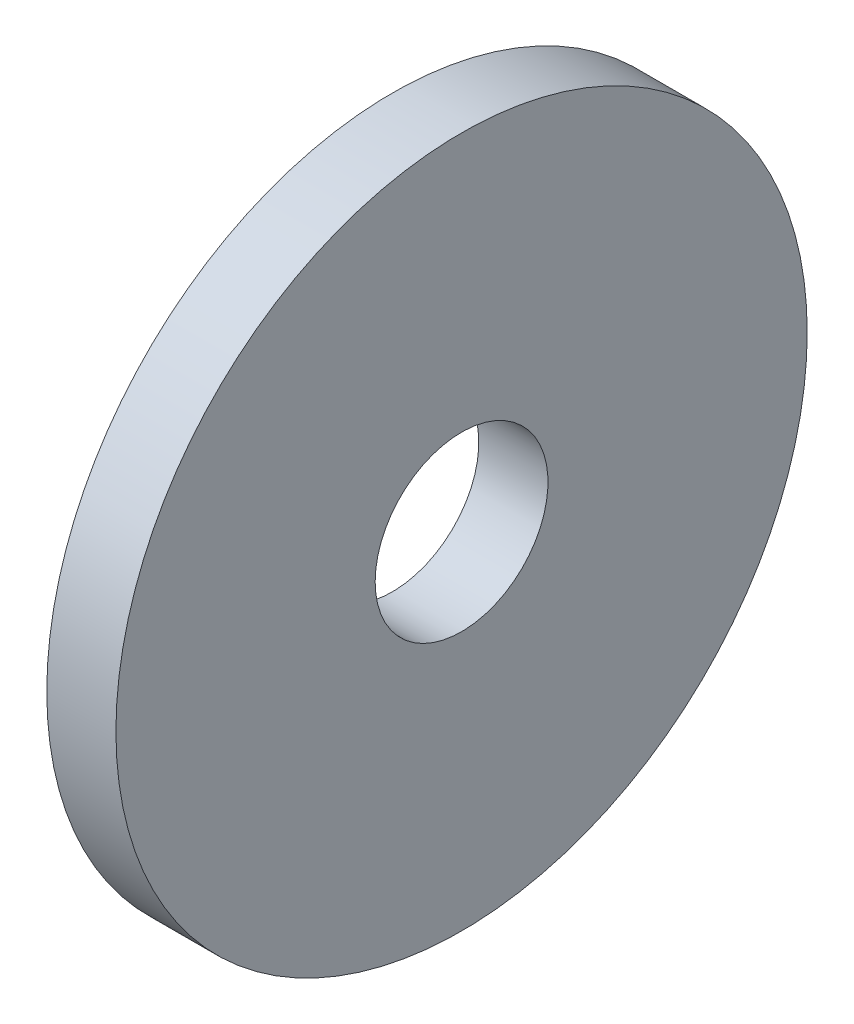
ISO-10303-21;
HEADER;
FILE_DESCRIPTION(('STEP AP214'),'2;1');
FILE_NAME('part.step','',(''),(''),'','','');
FILE_SCHEMA(('AUTOMOTIVE_DESIGN { 1 0 10303 214 1 1 1 1 }'));
ENDSEC;
DATA;
#1=APPLICATION_CONTEXT('core data for automotive mechanical design processes');
#2=APPLICATION_PROTOCOL_DEFINITION('international standard','automotive_design',2000,#1);
#3=PRODUCT_CONTEXT('',#1,'mechanical');
#4=PRODUCT('Part','Part','',(#3));
#5=PRODUCT_RELATED_PRODUCT_CATEGORY('part','',(#4));
#6=PRODUCT_DEFINITION_FORMATION('','',#4);
#7=PRODUCT_DEFINITION_CONTEXT('part definition',#1,'design');
#8=PRODUCT_DEFINITION('design','',#6,#7);
#9=PRODUCT_DEFINITION_SHAPE('','',#8);
#10=(LENGTH_UNIT() NAMED_UNIT(*) SI_UNIT(.MILLI.,.METRE.));
#11=(NAMED_UNIT(*) PLANE_ANGLE_UNIT() SI_UNIT($,.RADIAN.));
#12=(NAMED_UNIT(*) SI_UNIT($,.STERADIAN.) SOLID_ANGLE_UNIT());
#13=UNCERTAINTY_MEASURE_WITH_UNIT(LENGTH_MEASURE(1.E-05),#10,'distance_accuracy_value','');
#14=(GEOMETRIC_REPRESENTATION_CONTEXT(3) GLOBAL_UNCERTAINTY_ASSIGNED_CONTEXT((#13)) GLOBAL_UNIT_ASSIGNED_CONTEXT((#10,
#11,#12)) REPRESENTATION_CONTEXT('',''));
#15=CARTESIAN_POINT('',(0.,0.,0.));
#16=DIRECTION('',(0.,0.,1.));
#17=DIRECTION('',(1.,0.,0.));
#18=AXIS2_PLACEMENT_3D('',#15,#16,#17);
#19=CARTESIAN_POINT('',(1.35636,0.,0.));
#20=DIRECTION('',(1.,0.,0.));
#21=DIRECTION('',(0.,0.,-1.));
#22=AXIS2_PLACEMENT_3D('',#19,#20,#21);
#23=PLANE('',#22);
#24=CARTESIAN_POINT('',(1.35636,0.,0.));
#25=DIRECTION('',(1.,0.,0.));
#26=DIRECTION('',(0.,0.,-1.));
#27=AXIS2_PLACEMENT_3D('',#24,#25,#26);
#28=CIRCLE('',#27,6.7818);
#29=CARTESIAN_POINT('',(1.35636,0.,6.7818));
#30=VERTEX_POINT('',#29);
#31=EDGE_CURVE('E10',#30,#30,#28,.T.);
#32=ORIENTED_EDGE('',*,*,#31,.T.);
#33=EDGE_LOOP('',(#32));
#34=FACE_BOUND('',#33,.T.);
#35=CARTESIAN_POINT('',(1.35636,0.,0.));
#36=DIRECTION('',(1.,0.,0.));
#37=DIRECTION('',(0.,0.,-1.));
#38=AXIS2_PLACEMENT_3D('',#35,#36,#37);
#39=CIRCLE('',#38,1.69545);
#40=CARTESIAN_POINT('',(1.35636,0.,1.69545));
#41=VERTEX_POINT('',#40);
#42=EDGE_CURVE('E42',#41,#41,#39,.T.);
#43=ORIENTED_EDGE('',*,*,#42,.F.);
#44=EDGE_LOOP('',(#43));
#45=FACE_BOUND('',#44,.T.);
#46=ADVANCED_FACE('F31',(#34,#45),#23,.T.);
#47=CARTESIAN_POINT('',(0.,0.,0.));
#48=DIRECTION('',(1.,0.,0.));
#49=DIRECTION('',(0.,0.,-1.));
#50=AXIS2_PLACEMENT_3D('',#47,#48,#49);
#51=PLANE('',#50);
#52=CARTESIAN_POINT('',(0.,0.,0.));
#53=DIRECTION('',(1.,0.,0.));
#54=DIRECTION('',(0.,0.,-1.));
#55=AXIS2_PLACEMENT_3D('',#52,#53,#54);
#56=CIRCLE('',#55,6.7818);
#57=CARTESIAN_POINT('',(0.,0.,6.7818));
#58=VERTEX_POINT('',#57);
#59=EDGE_CURVE('E35',#58,#58,#56,.T.);
#60=ORIENTED_EDGE('',*,*,#59,.F.);
#61=EDGE_LOOP('',(#60));
#62=FACE_BOUND('',#61,.T.);
#63=CARTESIAN_POINT('',(0.,0.,0.));
#64=DIRECTION('',(1.,0.,0.));
#65=DIRECTION('',(0.,0.,-1.));
#66=AXIS2_PLACEMENT_3D('',#63,#64,#65);
#67=CIRCLE('',#66,1.69545);
#68=CARTESIAN_POINT('',(0.,0.,1.69545));
#69=VERTEX_POINT('',#68);
#70=EDGE_CURVE('E44',#69,#69,#67,.T.);
#71=ORIENTED_EDGE('',*,*,#70,.T.);
#72=EDGE_LOOP('',(#71));
#73=FACE_BOUND('',#72,.T.);
#74=ADVANCED_FACE('F54',(#62,#73),#51,.F.);
#75=CARTESIAN_POINT('',(1.35636,0.,0.));
#76=DIRECTION('',(-1.,0.,0.));
#77=DIRECTION('',(0.,0.,1.));
#78=AXIS2_PLACEMENT_3D('',#75,#76,#77);
#79=CYLINDRICAL_SURFACE('',#78,6.7818);
#80=CARTESIAN_POINT('',(1.35636,0.,6.7818));
#81=CARTESIAN_POINT('',(1.34223125,0.,6.7818));
#82=CARTESIAN_POINT('',(1.3281025,0.,6.7818));
#83=CARTESIAN_POINT('',(1.299845,0.,6.7818));
#84=CARTESIAN_POINT('',(1.28571625,0.,6.7818));
#85=CARTESIAN_POINT('',(1.25745875,0.,6.7818));
#86=CARTESIAN_POINT('',(1.24333,0.,6.7818));
#87=CARTESIAN_POINT('',(1.2150725,0.,6.7818));
#88=CARTESIAN_POINT('',(1.20094375,0.,6.7818));
#89=CARTESIAN_POINT('',(1.17268625,0.,6.7818));
#90=CARTESIAN_POINT('',(1.1585575,0.,6.7818));
#91=CARTESIAN_POINT('',(1.1303,0.,6.7818));
#92=CARTESIAN_POINT('',(1.11617125,0.,6.7818));
#93=CARTESIAN_POINT('',(1.08791375,0.,6.7818));
#94=CARTESIAN_POINT('',(1.073785,0.,6.7818));
#95=CARTESIAN_POINT('',(1.0455275,0.,6.7818));
#96=CARTESIAN_POINT('',(1.03139875,0.,6.7818));
#97=CARTESIAN_POINT('',(1.00314125,0.,6.7818));
#98=CARTESIAN_POINT('',(0.9890125,0.,6.7818));
#99=CARTESIAN_POINT('',(0.960755,0.,6.7818));
#100=CARTESIAN_POINT('',(0.94662625,0.,6.7818));
#101=CARTESIAN_POINT('',(0.91836875,0.,6.7818));
#102=CARTESIAN_POINT('',(0.90424,0.,6.7818));
#103=CARTESIAN_POINT('',(0.8759825,0.,6.7818));
#104=CARTESIAN_POINT('',(0.86185375,0.,6.7818));
#105=CARTESIAN_POINT('',(0.83359625,0.,6.7818));
#106=CARTESIAN_POINT('',(0.8194675,0.,6.7818));
#107=CARTESIAN_POINT('',(0.79121,0.,6.7818));
#108=CARTESIAN_POINT('',(0.77708125,0.,6.7818));
#109=CARTESIAN_POINT('',(0.74882375,0.,6.7818));
#110=CARTESIAN_POINT('',(0.734695,0.,6.7818));
#111=CARTESIAN_POINT('',(0.7064375,0.,6.7818));
#112=CARTESIAN_POINT('',(0.69230875,0.,6.7818));
#113=CARTESIAN_POINT('',(0.66405125,0.,6.7818));
#114=CARTESIAN_POINT('',(0.6499225,0.,6.7818));
#115=CARTESIAN_POINT('',(0.621665,0.,6.7818));
#116=CARTESIAN_POINT('',(0.60753625,0.,6.7818));
#117=CARTESIAN_POINT('',(0.57927875,0.,6.7818));
#118=CARTESIAN_POINT('',(0.56515,0.,6.7818));
#119=CARTESIAN_POINT('',(0.5368925,0.,6.7818));
#120=CARTESIAN_POINT('',(0.52276375,0.,6.7818));
#121=CARTESIAN_POINT('',(0.49450625,0.,6.7818));
#122=CARTESIAN_POINT('',(0.4803775,0.,6.7818));
#123=CARTESIAN_POINT('',(0.45212,0.,6.7818));
#124=CARTESIAN_POINT('',(0.43799125,0.,6.7818));
#125=CARTESIAN_POINT('',(0.40973375,0.,6.7818));
#126=CARTESIAN_POINT('',(0.395605,0.,6.7818));
#127=CARTESIAN_POINT('',(0.3673475,0.,6.7818));
#128=CARTESIAN_POINT('',(0.35321875,0.,6.7818));
#129=CARTESIAN_POINT('',(0.32496125,0.,6.7818));
#130=CARTESIAN_POINT('',(0.3108325,0.,6.7818));
#131=CARTESIAN_POINT('',(0.282575,0.,6.7818));
#132=CARTESIAN_POINT('',(0.26844625,0.,6.7818));
#133=CARTESIAN_POINT('',(0.24018875,0.,6.7818));
#134=CARTESIAN_POINT('',(0.22606,0.,6.7818));
#135=CARTESIAN_POINT('',(0.1978025,0.,6.7818));
#136=CARTESIAN_POINT('',(0.18367375,0.,6.7818));
#137=CARTESIAN_POINT('',(0.15541625,0.,6.7818));
#138=CARTESIAN_POINT('',(0.1412875,0.,6.7818));
#139=CARTESIAN_POINT('',(0.11303,0.,6.7818));
#140=CARTESIAN_POINT('',(0.0989012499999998,0.,6.7818));
#141=CARTESIAN_POINT('',(0.0706437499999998,0.,6.7818));
#142=CARTESIAN_POINT('',(0.0565149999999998,0.,6.7818));
#143=CARTESIAN_POINT('',(0.0282574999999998,0.,6.7818));
#144=CARTESIAN_POINT('',(0.0141287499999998,0.,6.7818));
#145=CARTESIAN_POINT('',(0.,0.,6.7818));
#146=B_SPLINE_CURVE_WITH_KNOTS('',3,(#80,#81,#82,#83,#84,#85,#86,#87,#88,#89,#90,#91,#92,#93,
#94,#95,#96,#97,#98,#99,#100,#101,#102,#103,#104,#105,#106,#107,#108,#109,#110,#111,#112,#113,
#114,#115,#116,#117,#118,#119,#120,#121,#122,#123,#124,#125,#126,#127,#128,#129,#130,#131,#132,
#133,#134,#135,#136,#137,#138,#139,#140,#141,#142,#143,#144,#145),.UNSPECIFIED.,.F.,.F.,(4,2,2,
2,2,2,2,2,2,2,2,2,2,2,2,2,2,2,2,2,2,2,2,2,2,2,2,2,2,2,2,2,4),(0.,0.04238625,0.0847725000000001,
0.12715875,0.169545,0.21193125,0.2543175,0.29670375,0.33909,0.38147625,0.4238625,0.46624875,
0.508635,0.55102125,0.5934075,0.63579375,0.67818,0.72056625,0.7629525,0.80533875,0.847725,
0.89011125,0.9324975,0.97488375,1.01727,1.05965625,1.1020425,1.14442875,1.186815,1.22920125,
1.2715875,1.31397375,1.35636),.UNSPECIFIED.);
#147=EDGE_CURVE('BSEAM33',#30,#58,#146,.T.);
#148=ORIENTED_EDGE('',*,*,#31,.F.);
#149=ORIENTED_EDGE('',*,*,#59,.T.);
#150=ORIENTED_EDGE('',*,*,#147,.T.);
#151=ORIENTED_EDGE('',*,*,#147,.F.);
#152=EDGE_LOOP('',(#148,#150,#149,#151));
#153=FACE_BOUND('',#152,.T.);
#154=ADVANCED_FACE('F33',(#153),#79,.T.);
#155=CARTESIAN_POINT('',(1.35636,0.,0.));
#156=DIRECTION('',(-1.,0.,0.));
#157=DIRECTION('',(0.,0.,1.));
#158=AXIS2_PLACEMENT_3D('',#155,#156,#157);
#159=CYLINDRICAL_SURFACE('',#158,1.69545);
#160=CARTESIAN_POINT('',(1.35636,0.,1.69545));
#161=CARTESIAN_POINT('',(1.34223125,0.,1.69545));
#162=CARTESIAN_POINT('',(1.3281025,0.,1.69545));
#163=CARTESIAN_POINT('',(1.299845,0.,1.69545));
#164=CARTESIAN_POINT('',(1.28571625,0.,1.69545));
#165=CARTESIAN_POINT('',(1.25745875,0.,1.69545));
#166=CARTESIAN_POINT('',(1.24333,0.,1.69545));
#167=CARTESIAN_POINT('',(1.2150725,0.,1.69545));
#168=CARTESIAN_POINT('',(1.20094375,0.,1.69545));
#169=CARTESIAN_POINT('',(1.17268625,0.,1.69545));
#170=CARTESIAN_POINT('',(1.1585575,0.,1.69545));
#171=CARTESIAN_POINT('',(1.1303,0.,1.69545));
#172=CARTESIAN_POINT('',(1.11617125,0.,1.69545));
#173=CARTESIAN_POINT('',(1.08791375,0.,1.69545));
#174=CARTESIAN_POINT('',(1.073785,0.,1.69545));
#175=CARTESIAN_POINT('',(1.0455275,0.,1.69545));
#176=CARTESIAN_POINT('',(1.03139875,0.,1.69545));
#177=CARTESIAN_POINT('',(1.00314125,0.,1.69545));
#178=CARTESIAN_POINT('',(0.9890125,0.,1.69545));
#179=CARTESIAN_POINT('',(0.960755,0.,1.69545));
#180=CARTESIAN_POINT('',(0.94662625,0.,1.69545));
#181=CARTESIAN_POINT('',(0.91836875,0.,1.69545));
#182=CARTESIAN_POINT('',(0.90424,0.,1.69545));
#183=CARTESIAN_POINT('',(0.8759825,0.,1.69545));
#184=CARTESIAN_POINT('',(0.86185375,0.,1.69545));
#185=CARTESIAN_POINT('',(0.83359625,0.,1.69545));
#186=CARTESIAN_POINT('',(0.8194675,0.,1.69545));
#187=CARTESIAN_POINT('',(0.79121,0.,1.69545));
#188=CARTESIAN_POINT('',(0.77708125,0.,1.69545));
#189=CARTESIAN_POINT('',(0.74882375,0.,1.69545));
#190=CARTESIAN_POINT('',(0.734695,0.,1.69545));
#191=CARTESIAN_POINT('',(0.7064375,0.,1.69545));
#192=CARTESIAN_POINT('',(0.69230875,0.,1.69545));
#193=CARTESIAN_POINT('',(0.66405125,0.,1.69545));
#194=CARTESIAN_POINT('',(0.6499225,0.,1.69545));
#195=CARTESIAN_POINT('',(0.621665,0.,1.69545));
#196=CARTESIAN_POINT('',(0.60753625,0.,1.69545));
#197=CARTESIAN_POINT('',(0.57927875,0.,1.69545));
#198=CARTESIAN_POINT('',(0.56515,0.,1.69545));
#199=CARTESIAN_POINT('',(0.5368925,0.,1.69545));
#200=CARTESIAN_POINT('',(0.52276375,0.,1.69545));
#201=CARTESIAN_POINT('',(0.49450625,0.,1.69545));
#202=CARTESIAN_POINT('',(0.4803775,0.,1.69545));
#203=CARTESIAN_POINT('',(0.45212,0.,1.69545));
#204=CARTESIAN_POINT('',(0.43799125,0.,1.69545));
#205=CARTESIAN_POINT('',(0.40973375,0.,1.69545));
#206=CARTESIAN_POINT('',(0.395605,0.,1.69545));
#207=CARTESIAN_POINT('',(0.3673475,0.,1.69545));
#208=CARTESIAN_POINT('',(0.35321875,0.,1.69545));
#209=CARTESIAN_POINT('',(0.32496125,0.,1.69545));
#210=CARTESIAN_POINT('',(0.3108325,0.,1.69545));
#211=CARTESIAN_POINT('',(0.282575,0.,1.69545));
#212=CARTESIAN_POINT('',(0.26844625,0.,1.69545));
#213=CARTESIAN_POINT('',(0.24018875,0.,1.69545));
#214=CARTESIAN_POINT('',(0.22606,0.,1.69545));
#215=CARTESIAN_POINT('',(0.1978025,0.,1.69545));
#216=CARTESIAN_POINT('',(0.18367375,0.,1.69545));
#217=CARTESIAN_POINT('',(0.15541625,0.,1.69545));
#218=CARTESIAN_POINT('',(0.1412875,0.,1.69545));
#219=CARTESIAN_POINT('',(0.11303,0.,1.69545));
#220=CARTESIAN_POINT('',(0.0989012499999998,0.,1.69545));
#221=CARTESIAN_POINT('',(0.0706437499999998,0.,1.69545));
#222=CARTESIAN_POINT('',(0.0565149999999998,0.,1.69545));
#223=CARTESIAN_POINT('',(0.0282574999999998,0.,1.69545));
#224=CARTESIAN_POINT('',(0.0141287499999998,0.,1.69545));
#225=CARTESIAN_POINT('',(0.,0.,1.69545));
#226=B_SPLINE_CURVE_WITH_KNOTS('',3,(#160,#161,#162,#163,#164,#165,#166,#167,#168,#169,#170,
#171,#172,#173,#174,#175,#176,#177,#178,#179,#180,#181,#182,#183,#184,#185,#186,#187,#188,#189,
#190,#191,#192,#193,#194,#195,#196,#197,#198,#199,#200,#201,#202,#203,#204,#205,#206,#207,#208,
#209,#210,#211,#212,#213,#214,#215,#216,#217,#218,#219,#220,#221,#222,#223,#224,#225),
.UNSPECIFIED.,.F.,.F.,(4,2,2,2,2,2,2,2,2,2,2,2,2,2,2,2,2,2,2,2,2,2,2,2,2,2,2,2,2,2,2,2,4),(0.,
0.04238625,0.0847725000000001,0.12715875,0.169545,0.21193125,0.2543175,0.29670375,0.33909,
0.38147625,0.4238625,0.46624875,0.508635,0.55102125,0.5934075,0.63579375,0.67818,0.72056625,
0.7629525,0.80533875,0.847725,0.89011125,0.9324975,0.97488375,1.01727,1.05965625,1.1020425,
1.14442875,1.186815,1.22920125,1.2715875,1.31397375,1.35636),.UNSPECIFIED.);
#227=EDGE_CURVE('BSEAM50',#41,#69,#226,.T.);
#228=ORIENTED_EDGE('',*,*,#42,.T.);
#229=ORIENTED_EDGE('',*,*,#70,.F.);
#230=ORIENTED_EDGE('',*,*,#227,.T.);
#231=ORIENTED_EDGE('',*,*,#227,.F.);
#232=EDGE_LOOP('',(#228,#230,#229,#231));
#233=FACE_BOUND('',#232,.T.);
#234=ADVANCED_FACE('F50',(#233),#159,.F.);
#235=CLOSED_SHELL('',(#46,#74,#154,#234));
#236=MANIFOLD_SOLID_BREP('B2',#235);
#237=ADVANCED_BREP_SHAPE_REPRESENTATION('',(#18,#236),#14);
#238=SHAPE_DEFINITION_REPRESENTATION(#9,#237);
ENDSEC;
END-ISO-10303-21;
